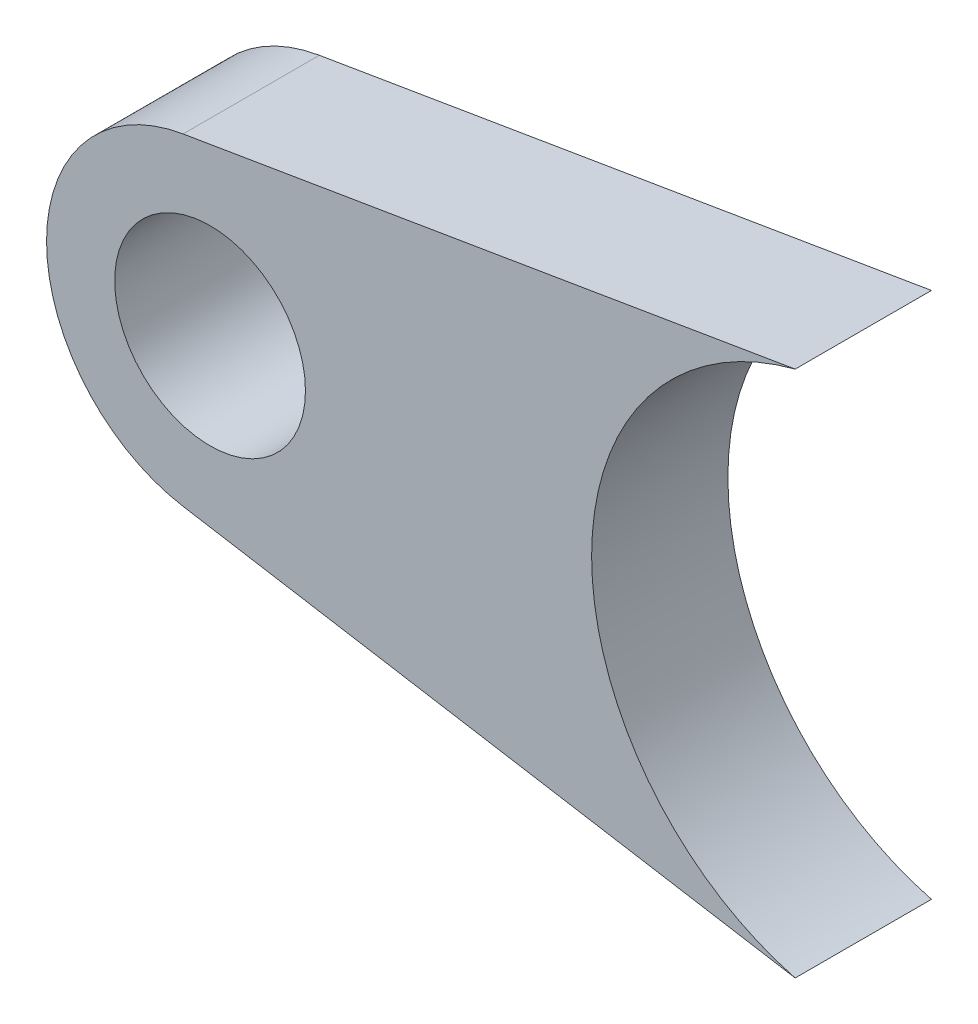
ISO-10303-21;
HEADER;
FILE_DESCRIPTION(('STEP AP214'),'2;1');
FILE_NAME('part.step','',(''),(''),'','','');
FILE_SCHEMA(('AUTOMOTIVE_DESIGN { 1 0 10303 214 1 1 1 1 }'));
ENDSEC;
DATA;
#1=APPLICATION_CONTEXT('core data for automotive mechanical design processes');
#2=APPLICATION_PROTOCOL_DEFINITION('international standard','automotive_design',2000,#1);
#3=PRODUCT_CONTEXT('',#1,'mechanical');
#4=PRODUCT('Part','Part','',(#3));
#5=PRODUCT_RELATED_PRODUCT_CATEGORY('part','',(#4));
#6=PRODUCT_DEFINITION_FORMATION('','',#4);
#7=PRODUCT_DEFINITION_CONTEXT('part definition',#1,'design');
#8=PRODUCT_DEFINITION('design','',#6,#7);
#9=PRODUCT_DEFINITION_SHAPE('','',#8);
#10=(LENGTH_UNIT() NAMED_UNIT(*) SI_UNIT(.MILLI.,.METRE.));
#11=(NAMED_UNIT(*) PLANE_ANGLE_UNIT() SI_UNIT($,.RADIAN.));
#12=(NAMED_UNIT(*) SI_UNIT($,.STERADIAN.) SOLID_ANGLE_UNIT());
#13=UNCERTAINTY_MEASURE_WITH_UNIT(LENGTH_MEASURE(1.E-05),#10,'distance_accuracy_value','');
#14=(GEOMETRIC_REPRESENTATION_CONTEXT(3) GLOBAL_UNCERTAINTY_ASSIGNED_CONTEXT((#13)) GLOBAL_UNIT_ASSIGNED_CONTEXT((#10,
#11,#12)) REPRESENTATION_CONTEXT('',''));
#15=CARTESIAN_POINT('',(0.,0.,0.));
#16=DIRECTION('',(0.,0.,1.));
#17=DIRECTION('',(1.,0.,0.));
#18=AXIS2_PLACEMENT_3D('',#15,#16,#17);
#19=CARTESIAN_POINT('',(0.,0.,25.));
#20=DIRECTION('',(0.,0.,1.));
#21=DIRECTION('',(1.,0.,0.));
#22=AXIS2_PLACEMENT_3D('',#19,#20,#21);
#23=PLANE('',#22);
#24=CARTESIAN_POINT('',(0.,0.,25.));
#25=DIRECTION('',(0.,0.,-1.));
#26=DIRECTION('',(1.,0.,0.));
#27=AXIS2_PLACEMENT_3D('',#24,#25,#26);
#28=CIRCLE('',#27,50.);
#29=CARTESIAN_POINT('',(-12.6530782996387,-48.3725088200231,25.));
#30=VERTEX_POINT('',#29);
#31=CARTESIAN_POINT('',(-12.6530782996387,48.3725088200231,25.));
#32=VERTEX_POINT('',#31);
#33=EDGE_CURVE('E97',#30,#32,#28,.T.);
#34=ORIENTED_EDGE('',*,*,#33,.T.);
#35=DIRECTION('',(-0.986297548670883,-0.164976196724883,0.));
#36=VECTOR('',#35,1.);
#37=CARTESIAN_POINT('',(-12.6530782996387,48.3725088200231,25.));
#38=LINE('',#37,#36);
#39=CARTESIAN_POINT('',(-124.949285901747,29.5889264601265,25.));
#40=VERTEX_POINT('',#39);
#41=EDGE_CURVE('E92',#32,#40,#38,.T.);
#42=ORIENTED_EDGE('',*,*,#41,.T.);
#43=CARTESIAN_POINT('',(-120.,0.,25.));
#44=DIRECTION('',(0.,0.,1.));
#45=DIRECTION('',(1.,0.,0.));
#46=AXIS2_PLACEMENT_3D('',#43,#44,#45);
#47=CIRCLE('',#46,30.);
#48=CARTESIAN_POINT('',(-124.949285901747,-29.5889264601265,25.));
#49=VERTEX_POINT('',#48);
#50=EDGE_CURVE('E95',#40,#49,#47,.T.);
#51=ORIENTED_EDGE('',*,*,#50,.T.);
#52=DIRECTION('',(0.986297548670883,-0.164976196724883,0.));
#53=VECTOR('',#52,1.);
#54=CARTESIAN_POINT('',(-124.949285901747,-29.5889264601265,25.));
#55=LINE('',#54,#53);
#56=EDGE_CURVE('E62',#49,#30,#55,.T.);
#57=ORIENTED_EDGE('',*,*,#56,.T.);
#58=EDGE_LOOP('',(#34,#42,#51,#57));
#59=FACE_BOUND('',#58,.T.);
#60=CARTESIAN_POINT('',(-120.,0.,25.));
#61=DIRECTION('',(0.,0.,1.));
#62=DIRECTION('',(1.,0.,0.));
#63=AXIS2_PLACEMENT_3D('',#60,#61,#62);
#64=CIRCLE('',#63,17.5);
#65=CARTESIAN_POINT('',(-102.5,0.,25.));
#66=VERTEX_POINT('',#65);
#67=EDGE_CURVE('E112',#66,#66,#64,.T.);
#68=ORIENTED_EDGE('',*,*,#67,.F.);
#69=EDGE_LOOP('',(#68));
#70=FACE_BOUND('',#69,.T.);
#71=ADVANCED_FACE('F45',(#59,#70),#23,.T.);
#72=CARTESIAN_POINT('',(0.,0.,0.));
#73=DIRECTION('',(0.,0.,1.));
#74=DIRECTION('',(1.,0.,0.));
#75=AXIS2_PLACEMENT_3D('',#72,#73,#74);
#76=PLANE('',#75);
#77=CARTESIAN_POINT('',(0.,0.,0.));
#78=DIRECTION('',(0.,0.,-1.));
#79=DIRECTION('',(1.,0.,0.));
#80=AXIS2_PLACEMENT_3D('',#77,#78,#79);
#81=CIRCLE('',#80,50.);
#82=CARTESIAN_POINT('',(-12.6530782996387,-48.3725088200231,0.));
#83=VERTEX_POINT('',#82);
#84=CARTESIAN_POINT('',(-12.6530782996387,48.3725088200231,0.));
#85=VERTEX_POINT('',#84);
#86=EDGE_CURVE('E109',#83,#85,#81,.T.);
#87=ORIENTED_EDGE('',*,*,#86,.F.);
#88=DIRECTION('',(0.986297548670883,-0.164976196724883,0.));
#89=VECTOR('',#88,1.);
#90=CARTESIAN_POINT('',(-124.949285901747,-29.5889264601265,0.));
#91=LINE('',#90,#89);
#92=CARTESIAN_POINT('',(-124.949285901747,-29.5889264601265,0.));
#93=VERTEX_POINT('',#92);
#94=EDGE_CURVE('E85',#93,#83,#91,.T.);
#95=ORIENTED_EDGE('',*,*,#94,.F.);
#96=CARTESIAN_POINT('',(-120.,0.,0.));
#97=DIRECTION('',(0.,0.,1.));
#98=DIRECTION('',(1.,0.,0.));
#99=AXIS2_PLACEMENT_3D('',#96,#97,#98);
#100=CIRCLE('',#99,30.);
#101=CARTESIAN_POINT('',(-124.949285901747,29.5889264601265,0.));
#102=VERTEX_POINT('',#101);
#103=EDGE_CURVE('E79',#102,#93,#100,.T.);
#104=ORIENTED_EDGE('',*,*,#103,.F.);
#105=DIRECTION('',(-0.986297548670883,-0.164976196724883,0.));
#106=VECTOR('',#105,1.);
#107=CARTESIAN_POINT('',(-12.6530782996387,48.3725088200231,0.));
#108=LINE('',#107,#106);
#109=EDGE_CURVE('E101',#85,#102,#108,.T.);
#110=ORIENTED_EDGE('',*,*,#109,.F.);
#111=EDGE_LOOP('',(#87,#95,#104,#110));
#112=FACE_BOUND('',#111,.T.);
#113=CARTESIAN_POINT('',(-120.,0.,0.));
#114=DIRECTION('',(0.,0.,1.));
#115=DIRECTION('',(1.,0.,0.));
#116=AXIS2_PLACEMENT_3D('',#113,#114,#115);
#117=CIRCLE('',#116,17.5);
#118=CARTESIAN_POINT('',(-102.5,0.,0.));
#119=VERTEX_POINT('',#118);
#120=EDGE_CURVE('E124',#119,#119,#117,.T.);
#121=ORIENTED_EDGE('',*,*,#120,.T.);
#122=EDGE_LOOP('',(#121));
#123=FACE_BOUND('',#122,.T.);
#124=ADVANCED_FACE('F120',(#112,#123),#76,.F.);
#125=CARTESIAN_POINT('',(0.,0.,25.));
#126=DIRECTION('',(0.,0.,-1.));
#127=DIRECTION('',(-1.,0.,0.));
#128=AXIS2_PLACEMENT_3D('',#125,#126,#127);
#129=CYLINDRICAL_SURFACE('',#128,50.);
#130=ORIENTED_EDGE('',*,*,#86,.T.);
#131=DIRECTION('',(0.,0.,-1.));
#132=VECTOR('',#131,1.);
#133=CARTESIAN_POINT('',(-12.6530782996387,48.3725088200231,25.));
#134=LINE('',#133,#132);
#135=EDGE_CURVE('E13',#32,#85,#134,.T.);
#136=ORIENTED_EDGE('',*,*,#135,.F.);
#137=ORIENTED_EDGE('',*,*,#33,.F.);
#138=DIRECTION('',(0.,0.,-1.));
#139=VECTOR('',#138,1.);
#140=CARTESIAN_POINT('',(-12.6530782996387,-48.3725088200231,25.));
#141=LINE('',#140,#139);
#142=EDGE_CURVE('E105',#30,#83,#141,.T.);
#143=ORIENTED_EDGE('',*,*,#142,.T.);
#144=EDGE_LOOP('',(#130,#136,#137,#143));
#145=FACE_BOUND('',#144,.T.);
#146=ADVANCED_FACE('F47',(#145),#129,.F.);
#147=CARTESIAN_POINT('',(-12.6530782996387,48.3725088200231,25.));
#148=DIRECTION('',(0.164976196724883,-0.986297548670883,0.));
#149=DIRECTION('',(0.986297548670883,0.164976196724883,0.));
#150=AXIS2_PLACEMENT_3D('',#147,#148,#149);
#151=PLANE('',#150);
#152=ORIENTED_EDGE('',*,*,#109,.T.);
#153=DIRECTION('',(0.,0.,-1.));
#154=VECTOR('',#153,1.);
#155=CARTESIAN_POINT('',(-124.949285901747,29.5889264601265,25.));
#156=LINE('',#155,#154);
#157=EDGE_CURVE('E54',#40,#102,#156,.T.);
#158=ORIENTED_EDGE('',*,*,#157,.F.);
#159=ORIENTED_EDGE('',*,*,#41,.F.);
#160=ORIENTED_EDGE('',*,*,#135,.T.);
#161=EDGE_LOOP('',(#152,#158,#159,#160));
#162=FACE_BOUND('',#161,.T.);
#163=ADVANCED_FACE('F100',(#162),#151,.F.);
#164=CARTESIAN_POINT('',(-120.,0.,25.));
#165=DIRECTION('',(0.,0.,-1.));
#166=DIRECTION('',(-1.,0.,0.));
#167=AXIS2_PLACEMENT_3D('',#164,#165,#166);
#168=CYLINDRICAL_SURFACE('',#167,30.);
#169=ORIENTED_EDGE('',*,*,#103,.T.);
#170=DIRECTION('',(0.,0.,-1.));
#171=VECTOR('',#170,1.);
#172=CARTESIAN_POINT('',(-124.949285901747,-29.5889264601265,25.));
#173=LINE('',#172,#171);
#174=EDGE_CURVE('E102',#49,#93,#173,.T.);
#175=ORIENTED_EDGE('',*,*,#174,.F.);
#176=ORIENTED_EDGE('',*,*,#50,.F.);
#177=ORIENTED_EDGE('',*,*,#157,.T.);
#178=EDGE_LOOP('',(#169,#175,#176,#177));
#179=FACE_BOUND('',#178,.T.);
#180=ADVANCED_FACE('F103',(#179),#168,.T.);
#181=CARTESIAN_POINT('',(-124.949285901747,-29.5889264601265,25.));
#182=DIRECTION('',(0.164976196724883,0.986297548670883,0.));
#183=DIRECTION('',(-0.986297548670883,0.164976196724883,0.));
#184=AXIS2_PLACEMENT_3D('',#181,#182,#183);
#185=PLANE('',#184);
#186=ORIENTED_EDGE('',*,*,#94,.T.);
#187=ORIENTED_EDGE('',*,*,#142,.F.);
#188=ORIENTED_EDGE('',*,*,#56,.F.);
#189=ORIENTED_EDGE('',*,*,#174,.T.);
#190=EDGE_LOOP('',(#186,#187,#188,#189));
#191=FACE_BOUND('',#190,.T.);
#192=ADVANCED_FACE('F117',(#191),#185,.F.);
#193=CARTESIAN_POINT('',(-120.,0.,25.));
#194=DIRECTION('',(0.,0.,-1.));
#195=DIRECTION('',(-1.,0.,0.));
#196=AXIS2_PLACEMENT_3D('',#193,#194,#195);
#197=CYLINDRICAL_SURFACE('',#196,17.5);
#198=ORIENTED_EDGE('',*,*,#67,.T.);
#199=EDGE_LOOP('',(#198));
#200=FACE_BOUND('',#199,.T.);
#201=ORIENTED_EDGE('',*,*,#120,.F.);
#202=EDGE_LOOP('',(#201));
#203=FACE_BOUND('',#202,.T.);
#204=ADVANCED_FACE('F130',(#200,#203),#197,.F.);
#205=CLOSED_SHELL('',(#71,#124,#146,#163,#180,#192,#204));
#206=MANIFOLD_SOLID_BREP('B2',#205);
#207=ADVANCED_BREP_SHAPE_REPRESENTATION('',(#18,#206),#14);
#208=SHAPE_DEFINITION_REPRESENTATION(#9,#207);
ENDSEC;
END-ISO-10303-21;
